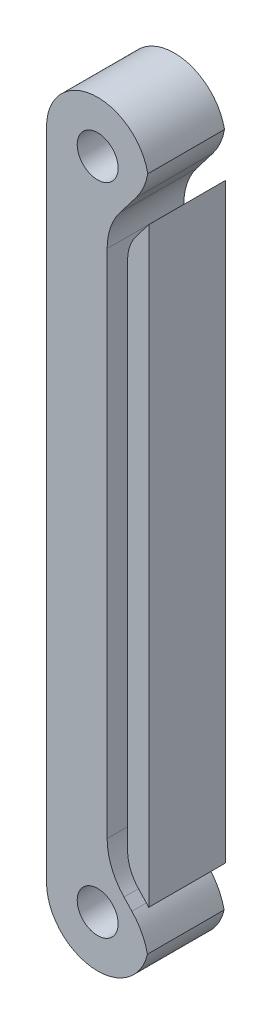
ISO-10303-21;
HEADER;
FILE_DESCRIPTION(('STEP AP214'),'2;1');
FILE_NAME('part.step','',(''),(''),'','','');
FILE_SCHEMA(('AUTOMOTIVE_DESIGN { 1 0 10303 214 1 1 1 1 }'));
ENDSEC;
DATA;
#1=APPLICATION_CONTEXT('core data for automotive mechanical design processes');
#2=APPLICATION_PROTOCOL_DEFINITION('international standard','automotive_design',2000,#1);
#3=PRODUCT_CONTEXT('',#1,'mechanical');
#4=PRODUCT('Part','Part','',(#3));
#5=PRODUCT_RELATED_PRODUCT_CATEGORY('part','',(#4));
#6=PRODUCT_DEFINITION_FORMATION('','',#4);
#7=PRODUCT_DEFINITION_CONTEXT('part definition',#1,'design');
#8=PRODUCT_DEFINITION('design','',#6,#7);
#9=PRODUCT_DEFINITION_SHAPE('','',#8);
#10=(LENGTH_UNIT() NAMED_UNIT(*) SI_UNIT(.MILLI.,.METRE.));
#11=(NAMED_UNIT(*) PLANE_ANGLE_UNIT() SI_UNIT($,.RADIAN.));
#12=(NAMED_UNIT(*) SI_UNIT($,.STERADIAN.) SOLID_ANGLE_UNIT());
#13=UNCERTAINTY_MEASURE_WITH_UNIT(LENGTH_MEASURE(1.E-05),#10,'distance_accuracy_value','');
#14=(GEOMETRIC_REPRESENTATION_CONTEXT(3) GLOBAL_UNCERTAINTY_ASSIGNED_CONTEXT((#13)) GLOBAL_UNIT_ASSIGNED_CONTEXT((#10,
#11,#12)) REPRESENTATION_CONTEXT('',''));
#15=CARTESIAN_POINT('',(0.,0.,0.));
#16=DIRECTION('',(0.,0.,1.));
#17=DIRECTION('',(1.,0.,0.));
#18=AXIS2_PLACEMENT_3D('',#15,#16,#17);
#19=CARTESIAN_POINT('',(0.,40.64,9.525));
#20=DIRECTION('',(0.,0.,1.));
#21=DIRECTION('',(1.,0.,0.));
#22=AXIS2_PLACEMENT_3D('',#19,#20,#21);
#23=PLANE('',#22);
#24=CARTESIAN_POINT('',(-1.27,43.2241388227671,9.525));
#25=DIRECTION('',(0.,0.,-1.));
#26=DIRECTION('',(1.,0.,0.));
#27=AXIS2_PLACEMENT_3D('',#24,#25,#26);
#28=CIRCLE('',#27,7.62);
#29=CARTESIAN_POINT('',(6.22920112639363,41.8727016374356,9.525));
#30=VERTEX_POINT('',#29);
#31=CARTESIAN_POINT('',(4.77808385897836,38.5889385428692,9.525));
#32=VERTEX_POINT('',#31);
#33=EDGE_CURVE('E183',#30,#32,#28,.T.);
#34=ORIENTED_EDGE('',*,*,#33,.F.);
#35=CARTESIAN_POINT('',(0.,40.64,9.525));
#36=DIRECTION('',(0.,0.,1.));
#37=DIRECTION('',(1.,0.,0.));
#38=AXIS2_PLACEMENT_3D('',#35,#36,#37);
#39=CIRCLE('',#38,6.35);
#40=CARTESIAN_POINT('',(-6.35,40.64,9.525));
#41=VERTEX_POINT('',#40);
#42=EDGE_CURVE('E166',#30,#41,#39,.T.);
#43=ORIENTED_EDGE('',*,*,#42,.T.);
#44=DIRECTION('',(0.,-1.,0.));
#45=VECTOR('',#44,1.);
#46=CARTESIAN_POINT('',(-6.35,-40.64,9.525));
#47=LINE('',#46,#45);
#48=CARTESIAN_POINT('',(-6.35,-40.64,9.525));
#49=VERTEX_POINT('',#48);
#50=EDGE_CURVE('E163',#41,#49,#47,.T.);
#51=ORIENTED_EDGE('',*,*,#50,.T.);
#52=CARTESIAN_POINT('',(0.,-40.64,9.525));
#53=DIRECTION('',(0.,0.,1.));
#54=DIRECTION('',(-1.,0.,0.));
#55=AXIS2_PLACEMENT_3D('',#52,#53,#54);
#56=CIRCLE('',#55,6.35);
#57=CARTESIAN_POINT('',(6.18231703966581,-42.0896399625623,9.525));
#58=VERTEX_POINT('',#57);
#59=EDGE_CURVE('E160',#49,#58,#56,.T.);
#60=ORIENTED_EDGE('',*,*,#59,.T.);
#61=CARTESIAN_POINT('',(-1.27,-43.6794106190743,9.525));
#62=DIRECTION('',(0.,0.,-1.));
#63=DIRECTION('',(-1.,0.,0.));
#64=AXIS2_PLACEMENT_3D('',#61,#62,#63);
#65=CIRCLE('',#64,7.62);
#66=CARTESIAN_POINT('',(4.25813786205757,-38.434976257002,9.525));
#67=VERTEX_POINT('',#66);
#68=EDGE_CURVE('E12',#67,#58,#65,.T.);
#69=ORIENTED_EDGE('',*,*,#68,.F.);
#70=DIRECTION('',(0.688245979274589,-0.725477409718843,0.));
#71=VECTOR('',#70,1.);
#72=CARTESIAN_POINT('',(3.26864550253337,-37.3919562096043,9.525));
#73=LINE('',#72,#71);
#74=CARTESIAN_POINT('',(3.26864550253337,-37.3919562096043,9.525));
#75=VERTEX_POINT('',#74);
#76=EDGE_CURVE('E123',#75,#67,#73,.T.);
#77=ORIENTED_EDGE('',*,*,#76,.F.);
#78=CARTESIAN_POINT('',(8.79678336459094,-32.147521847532,9.525));
#79=DIRECTION('',(0.,0.,1.));
#80=DIRECTION('',(1.,0.,0.));
#81=AXIS2_PLACEMENT_3D('',#78,#79,#80);
#82=CIRCLE('',#81,7.62);
#83=CARTESIAN_POINT('',(1.17678336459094,-32.1475218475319,9.525));
#84=VERTEX_POINT('',#83);
#85=EDGE_CURVE('E45',#84,#75,#82,.T.);
#86=ORIENTED_EDGE('',*,*,#85,.F.);
#87=DIRECTION('',(0.,-1.,0.));
#88=VECTOR('',#87,1.);
#89=CARTESIAN_POINT('',(1.17678336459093,31.3057649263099,9.525));
#90=LINE('',#89,#88);
#91=CARTESIAN_POINT('',(1.17678336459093,31.3057649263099,9.525));
#92=VERTEX_POINT('',#91);
#93=EDGE_CURVE('E189',#92,#84,#90,.T.);
#94=ORIENTED_EDGE('',*,*,#93,.F.);
#95=CARTESIAN_POINT('',(8.79678336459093,31.3057649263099,9.525));
#96=DIRECTION('',(0.,0.,1.));
#97=DIRECTION('',(1.,0.,0.));
#98=AXIS2_PLACEMENT_3D('',#95,#96,#97);
#99=CIRCLE('',#98,7.62);
#100=CARTESIAN_POINT('',(2.74869950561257,35.9409652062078,9.525));
#101=VERTEX_POINT('',#100);
#102=EDGE_CURVE('E186',#101,#92,#99,.T.);
#103=ORIENTED_EDGE('',*,*,#102,.F.);
#104=DIRECTION('',(-0.608293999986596,-0.793711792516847,0.));
#105=VECTOR('',#104,1.);
#106=CARTESIAN_POINT('',(4.77808385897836,38.5889385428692,9.525));
#107=LINE('',#106,#105);
#108=EDGE_CURVE('E124',#32,#101,#107,.T.);
#109=ORIENTED_EDGE('',*,*,#108,.F.);
#110=EDGE_LOOP('',(#34,#43,#51,#60,#69,#77,#86,#94,#103,#109));
#111=FACE_BOUND('',#110,.T.);
#112=CARTESIAN_POINT('',(0.,40.64,9.525));
#113=DIRECTION('',(0.,0.,1.));
#114=DIRECTION('',(1.,0.,0.));
#115=AXIS2_PLACEMENT_3D('',#112,#113,#114);
#116=CIRCLE('',#115,2.54);
#117=CARTESIAN_POINT('',(-2.54,40.64,9.525));
#118=VERTEX_POINT('',#117);
#119=EDGE_CURVE('E153',#118,#118,#116,.T.);
#120=ORIENTED_EDGE('',*,*,#119,.F.);
#121=EDGE_LOOP('',(#120));
#122=FACE_BOUND('',#121,.T.);
#123=CARTESIAN_POINT('',(0.,-40.64,9.525));
#124=DIRECTION('',(0.,0.,1.));
#125=DIRECTION('',(1.,0.,0.));
#126=AXIS2_PLACEMENT_3D('',#123,#124,#125);
#127=CIRCLE('',#126,2.54);
#128=CARTESIAN_POINT('',(-2.54,-40.64,9.525));
#129=VERTEX_POINT('',#128);
#130=EDGE_CURVE('E174',#129,#129,#127,.T.);
#131=ORIENTED_EDGE('',*,*,#130,.F.);
#132=EDGE_LOOP('',(#131));
#133=FACE_BOUND('',#132,.T.);
#134=ADVANCED_FACE('F42',(#111,#122,#133),#23,.T.);
#135=CARTESIAN_POINT('',(0.,40.64,0.));
#136=DIRECTION('',(0.,0.,1.));
#137=DIRECTION('',(1.,0.,0.));
#138=AXIS2_PLACEMENT_3D('',#135,#136,#137);
#139=PLANE('',#138);
#140=CARTESIAN_POINT('',(0.,40.64,0.));
#141=DIRECTION('',(0.,0.,1.));
#142=DIRECTION('',(1.,0.,0.));
#143=AXIS2_PLACEMENT_3D('',#140,#141,#142);
#144=CIRCLE('',#143,6.35);
#145=CARTESIAN_POINT('',(6.22920112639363,41.8727016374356,0.));
#146=VERTEX_POINT('',#145);
#147=CARTESIAN_POINT('',(-6.35,40.64,0.));
#148=VERTEX_POINT('',#147);
#149=EDGE_CURVE('E140',#146,#148,#144,.T.);
#150=ORIENTED_EDGE('',*,*,#149,.F.);
#151=CARTESIAN_POINT('',(-1.27,43.2241388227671,0.));
#152=DIRECTION('',(0.,0.,1.));
#153=DIRECTION('',(1.,0.,0.));
#154=AXIS2_PLACEMENT_3D('',#151,#152,#153);
#155=CIRCLE('',#154,7.62);
#156=CARTESIAN_POINT('',(4.77808385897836,38.5889385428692,0.));
#157=VERTEX_POINT('',#156);
#158=EDGE_CURVE('E95',#146,#157,#155,.F.);
#159=ORIENTED_EDGE('',*,*,#158,.T.);
#160=DIRECTION('',(-0.608293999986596,-0.793711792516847,0.));
#161=VECTOR('',#160,1.);
#162=CARTESIAN_POINT('',(4.00036290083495,37.5741557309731,0.));
#163=LINE('',#162,#161);
#164=CARTESIAN_POINT('',(2.74869950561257,35.9409652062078,0.));
#165=VERTEX_POINT('',#164);
#166=EDGE_CURVE('E103',#157,#165,#163,.T.);
#167=ORIENTED_EDGE('',*,*,#166,.T.);
#168=CARTESIAN_POINT('',(8.79678336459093,31.3057649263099,0.));
#169=DIRECTION('',(0.,0.,1.));
#170=DIRECTION('',(1.,0.,0.));
#171=AXIS2_PLACEMENT_3D('',#168,#169,#170);
#172=CIRCLE('',#171,7.62);
#173=CARTESIAN_POINT('',(1.17678336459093,31.3057649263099,0.));
#174=VERTEX_POINT('',#173);
#175=EDGE_CURVE('E134',#165,#174,#172,.T.);
#176=ORIENTED_EDGE('',*,*,#175,.T.);
#177=DIRECTION('',(0.,-1.,0.));
#178=VECTOR('',#177,1.);
#179=CARTESIAN_POINT('',(1.17678336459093,40.64,0.));
#180=LINE('',#179,#178);
#181=CARTESIAN_POINT('',(1.17678336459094,-32.1475218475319,0.));
#182=VERTEX_POINT('',#181);
#183=EDGE_CURVE('E132',#174,#182,#180,.T.);
#184=ORIENTED_EDGE('',*,*,#183,.T.);
#185=CARTESIAN_POINT('',(8.79678336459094,-32.147521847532,0.));
#186=DIRECTION('',(0.,0.,1.));
#187=DIRECTION('',(1.,0.,0.));
#188=AXIS2_PLACEMENT_3D('',#185,#186,#187);
#189=CIRCLE('',#188,7.62);
#190=CARTESIAN_POINT('',(3.26864550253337,-37.3919562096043,0.));
#191=VERTEX_POINT('',#190);
#192=EDGE_CURVE('E115',#182,#191,#189,.T.);
#193=ORIENTED_EDGE('',*,*,#192,.T.);
#194=DIRECTION('',(0.688245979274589,-0.725477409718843,0.));
#195=VECTOR('',#194,1.);
#196=CARTESIAN_POINT('',(-37.2415497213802,5.30968300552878,0.));
#197=LINE('',#196,#195);
#198=CARTESIAN_POINT('',(4.25813786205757,-38.434976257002,0.));
#199=VERTEX_POINT('',#198);
#200=EDGE_CURVE('E111',#191,#199,#197,.T.);
#201=ORIENTED_EDGE('',*,*,#200,.T.);
#202=CARTESIAN_POINT('',(-1.27,-43.6794106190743,0.));
#203=DIRECTION('',(0.,0.,1.));
#204=DIRECTION('',(1.,0.,0.));
#205=AXIS2_PLACEMENT_3D('',#202,#203,#204);
#206=CIRCLE('',#205,7.62);
#207=CARTESIAN_POINT('',(6.18231703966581,-42.0896399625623,0.));
#208=VERTEX_POINT('',#207);
#209=EDGE_CURVE('E60',#199,#208,#206,.F.);
#210=ORIENTED_EDGE('',*,*,#209,.T.);
#211=CARTESIAN_POINT('',(0.,-40.64,0.));
#212=DIRECTION('',(0.,0.,1.));
#213=DIRECTION('',(-1.,0.,0.));
#214=AXIS2_PLACEMENT_3D('',#211,#212,#213);
#215=CIRCLE('',#214,6.35);
#216=CARTESIAN_POINT('',(-6.35,-40.64,0.));
#217=VERTEX_POINT('',#216);
#218=EDGE_CURVE('E146',#217,#208,#215,.T.);
#219=ORIENTED_EDGE('',*,*,#218,.F.);
#220=DIRECTION('',(0.,-1.,0.));
#221=VECTOR('',#220,1.);
#222=CARTESIAN_POINT('',(-6.35,-40.64,0.));
#223=LINE('',#222,#221);
#224=EDGE_CURVE('E150',#148,#217,#223,.T.);
#225=ORIENTED_EDGE('',*,*,#224,.F.);
#226=EDGE_LOOP('',(#150,#159,#167,#176,#184,#193,#201,#210,#219,#225));
#227=FACE_BOUND('',#226,.T.);
#228=CARTESIAN_POINT('',(0.,40.64,0.));
#229=DIRECTION('',(0.,0.,1.));
#230=DIRECTION('',(1.,0.,0.));
#231=AXIS2_PLACEMENT_3D('',#228,#229,#230);
#232=CIRCLE('',#231,2.54);
#233=CARTESIAN_POINT('',(-2.54,40.64,0.));
#234=VERTEX_POINT('',#233);
#235=EDGE_CURVE('E169',#234,#234,#232,.T.);
#236=ORIENTED_EDGE('',*,*,#235,.T.);
#237=EDGE_LOOP('',(#236));
#238=FACE_BOUND('',#237,.T.);
#239=CARTESIAN_POINT('',(0.,-40.64,0.));
#240=DIRECTION('',(0.,0.,1.));
#241=DIRECTION('',(1.,0.,0.));
#242=AXIS2_PLACEMENT_3D('',#239,#240,#241);
#243=CIRCLE('',#242,2.54);
#244=CARTESIAN_POINT('',(-2.54,-40.64,0.));
#245=VERTEX_POINT('',#244);
#246=EDGE_CURVE('E141',#245,#245,#243,.T.);
#247=ORIENTED_EDGE('',*,*,#246,.T.);
#248=EDGE_LOOP('',(#247));
#249=FACE_BOUND('',#248,.T.);
#250=ADVANCED_FACE('F128',(#227,#238,#249),#139,.F.);
#251=CARTESIAN_POINT('',(0.,40.64,9.525));
#252=DIRECTION('',(0.,0.,-1.));
#253=DIRECTION('',(-1.,0.,0.));
#254=AXIS2_PLACEMENT_3D('',#251,#252,#253);
#255=CYLINDRICAL_SURFACE('',#254,6.35);
#256=ORIENTED_EDGE('',*,*,#42,.F.);
#257=DIRECTION('',(0.,0.,1.));
#258=VECTOR('',#257,1.);
#259=CARTESIAN_POINT('',(6.22920112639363,41.8727016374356,4.445));
#260=LINE('',#259,#258);
#261=EDGE_CURVE('E138',#30,#146,#260,.F.);
#262=ORIENTED_EDGE('',*,*,#261,.T.);
#263=ORIENTED_EDGE('',*,*,#149,.T.);
#264=DIRECTION('',(0.,0.,-1.));
#265=VECTOR('',#264,1.);
#266=CARTESIAN_POINT('',(-6.35,40.64,9.525));
#267=LINE('',#266,#265);
#268=EDGE_CURVE('E147',#41,#148,#267,.T.);
#269=ORIENTED_EDGE('',*,*,#268,.F.);
#270=EDGE_LOOP('',(#256,#262,#263,#269));
#271=FACE_BOUND('',#270,.T.);
#272=ADVANCED_FACE('F232',(#271),#255,.T.);
#273=CARTESIAN_POINT('',(-6.35,-40.64,9.525));
#274=DIRECTION('',(1.,0.,0.));
#275=DIRECTION('',(0.,0.,-1.));
#276=AXIS2_PLACEMENT_3D('',#273,#274,#275);
#277=PLANE('',#276);
#278=ORIENTED_EDGE('',*,*,#224,.T.);
#279=DIRECTION('',(0.,0.,-1.));
#280=VECTOR('',#279,1.);
#281=CARTESIAN_POINT('',(-6.35,-40.64,9.525));
#282=LINE('',#281,#280);
#283=EDGE_CURVE('E145',#49,#217,#282,.T.);
#284=ORIENTED_EDGE('',*,*,#283,.F.);
#285=ORIENTED_EDGE('',*,*,#50,.F.);
#286=ORIENTED_EDGE('',*,*,#268,.T.);
#287=EDGE_LOOP('',(#278,#284,#285,#286));
#288=FACE_BOUND('',#287,.T.);
#289=ADVANCED_FACE('F254',(#288),#277,.F.);
#290=CARTESIAN_POINT('',(0.,-40.64,9.525));
#291=DIRECTION('',(0.,0.,-1.));
#292=DIRECTION('',(-1.,0.,0.));
#293=AXIS2_PLACEMENT_3D('',#290,#291,#292);
#294=CYLINDRICAL_SURFACE('',#293,6.35);
#295=ORIENTED_EDGE('',*,*,#218,.T.);
#296=DIRECTION('',(0.,0.,1.));
#297=VECTOR('',#296,1.);
#298=CARTESIAN_POINT('',(6.18231703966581,-42.0896399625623,4.445));
#299=LINE('',#298,#297);
#300=EDGE_CURVE('E142',#208,#58,#299,.T.);
#301=ORIENTED_EDGE('',*,*,#300,.T.);
#302=ORIENTED_EDGE('',*,*,#59,.F.);
#303=ORIENTED_EDGE('',*,*,#283,.T.);
#304=EDGE_LOOP('',(#295,#301,#302,#303));
#305=FACE_BOUND('',#304,.T.);
#306=ADVANCED_FACE('F207',(#305),#294,.T.);
#307=CARTESIAN_POINT('',(0.,40.64,9.525));
#308=DIRECTION('',(0.,0.,-1.));
#309=DIRECTION('',(-1.,0.,0.));
#310=AXIS2_PLACEMENT_3D('',#307,#308,#309);
#311=CYLINDRICAL_SURFACE('',#310,2.54);
#312=CARTESIAN_POINT('',(-2.54,40.64,9.525));
#313=CARTESIAN_POINT('',(-2.54,40.64,9.42578125));
#314=CARTESIAN_POINT('',(-2.54,40.64,9.3265625));
#315=CARTESIAN_POINT('',(-2.54,40.64,9.128125));
#316=CARTESIAN_POINT('',(-2.54,40.64,9.02890625));
#317=CARTESIAN_POINT('',(-2.54,40.64,8.83046875));
#318=CARTESIAN_POINT('',(-2.54,40.64,8.73125));
#319=CARTESIAN_POINT('',(-2.54,40.64,8.5328125));
#320=CARTESIAN_POINT('',(-2.54,40.64,8.43359375));
#321=CARTESIAN_POINT('',(-2.54,40.64,8.23515625));
#322=CARTESIAN_POINT('',(-2.54,40.64,8.1359375));
#323=CARTESIAN_POINT('',(-2.54,40.64,7.9375));
#324=CARTESIAN_POINT('',(-2.54,40.64,7.83828125));
#325=CARTESIAN_POINT('',(-2.54,40.64,7.63984375));
#326=CARTESIAN_POINT('',(-2.54,40.64,7.540625));
#327=CARTESIAN_POINT('',(-2.54,40.64,7.3421875));
#328=CARTESIAN_POINT('',(-2.54,40.64,7.24296875));
#329=CARTESIAN_POINT('',(-2.54,40.64,7.04453125));
#330=CARTESIAN_POINT('',(-2.54,40.64,6.9453125));
#331=CARTESIAN_POINT('',(-2.54,40.64,6.746875));
#332=CARTESIAN_POINT('',(-2.54,40.64,6.64765625));
#333=CARTESIAN_POINT('',(-2.54,40.64,6.44921875));
#334=CARTESIAN_POINT('',(-2.54,40.64,6.35));
#335=CARTESIAN_POINT('',(-2.54,40.64,6.1515625));
#336=CARTESIAN_POINT('',(-2.54,40.64,6.05234375));
#337=CARTESIAN_POINT('',(-2.54,40.64,5.85390625));
#338=CARTESIAN_POINT('',(-2.54,40.64,5.7546875));
#339=CARTESIAN_POINT('',(-2.54,40.64,5.55625));
#340=CARTESIAN_POINT('',(-2.54,40.64,5.45703125));
#341=CARTESIAN_POINT('',(-2.54,40.64,5.25859375));
#342=CARTESIAN_POINT('',(-2.54,40.64,5.159375));
#343=CARTESIAN_POINT('',(-2.54,40.64,4.9609375));
#344=CARTESIAN_POINT('',(-2.54,40.64,4.86171875));
#345=CARTESIAN_POINT('',(-2.54,40.64,4.66328125));
#346=CARTESIAN_POINT('',(-2.54,40.64,4.5640625));
#347=CARTESIAN_POINT('',(-2.54,40.64,4.365625));
#348=CARTESIAN_POINT('',(-2.54,40.64,4.26640625));
#349=CARTESIAN_POINT('',(-2.54,40.64,4.06796875));
#350=CARTESIAN_POINT('',(-2.54,40.64,3.96875));
#351=CARTESIAN_POINT('',(-2.54,40.64,3.7703125));
#352=CARTESIAN_POINT('',(-2.54,40.64,3.67109375));
#353=CARTESIAN_POINT('',(-2.54,40.64,3.47265625));
#354=CARTESIAN_POINT('',(-2.54,40.64,3.3734375));
#355=CARTESIAN_POINT('',(-2.54,40.64,3.175));
#356=CARTESIAN_POINT('',(-2.54,40.64,3.07578125));
#357=CARTESIAN_POINT('',(-2.54,40.64,2.87734375));
#358=CARTESIAN_POINT('',(-2.54,40.64,2.778125));
#359=CARTESIAN_POINT('',(-2.54,40.64,2.5796875));
#360=CARTESIAN_POINT('',(-2.54,40.64,2.48046875));
#361=CARTESIAN_POINT('',(-2.54,40.64,2.28203125));
#362=CARTESIAN_POINT('',(-2.54,40.64,2.1828125));
#363=CARTESIAN_POINT('',(-2.54,40.64,1.984375));
#364=CARTESIAN_POINT('',(-2.54,40.64,1.88515625));
#365=CARTESIAN_POINT('',(-2.54,40.64,1.68671875));
#366=CARTESIAN_POINT('',(-2.54,40.64,1.5875));
#367=CARTESIAN_POINT('',(-2.54,40.64,1.3890625));
#368=CARTESIAN_POINT('',(-2.54,40.64,1.28984375));
#369=CARTESIAN_POINT('',(-2.54,40.64,1.09140625));
#370=CARTESIAN_POINT('',(-2.54,40.64,0.992187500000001));
#371=CARTESIAN_POINT('',(-2.54,40.64,0.793750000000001));
#372=CARTESIAN_POINT('',(-2.54,40.64,0.69453125));
#373=CARTESIAN_POINT('',(-2.54,40.64,0.49609375));
#374=CARTESIAN_POINT('',(-2.54,40.64,0.396875));
#375=CARTESIAN_POINT('',(-2.54,40.64,0.1984375));
#376=CARTESIAN_POINT('',(-2.54,40.64,0.0992187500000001));
#377=CARTESIAN_POINT('',(-2.54,40.64,0.));
#378=B_SPLINE_CURVE_WITH_KNOTS('',3,(#312,#313,#314,#315,#316,#317,#318,#319,#320,#321,#322,
#323,#324,#325,#326,#327,#328,#329,#330,#331,#332,#333,#334,#335,#336,#337,#338,#339,#340,#341,
#342,#343,#344,#345,#346,#347,#348,#349,#350,#351,#352,#353,#354,#355,#356,#357,#358,#359,#360,
#361,#362,#363,#364,#365,#366,#367,#368,#369,#370,#371,#372,#373,#374,#375,#376,#377),
.UNSPECIFIED.,.F.,.F.,(4,2,2,2,2,2,2,2,2,2,2,2,2,2,2,2,2,2,2,2,2,2,2,2,2,2,2,2,2,2,2,2,4),(0.,
0.297656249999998,0.595312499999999,0.892968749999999,1.190625,1.48828125,1.7859375,2.08359375,
2.38125,2.67890625,2.9765625,3.27421875,3.571875,3.86953125,4.1671875,4.46484375,4.7625,
5.06015625,5.3578125,5.65546875,5.953125,6.25078125,6.5484375,6.84609375,7.14375,7.44140625,
7.7390625,8.03671875,8.334375,8.63203125,8.9296875,9.22734375,9.525),.UNSPECIFIED.);
#379=EDGE_CURVE('BSEAM263',#118,#234,#378,.T.);
#380=ORIENTED_EDGE('',*,*,#119,.T.);
#381=ORIENTED_EDGE('',*,*,#235,.F.);
#382=ORIENTED_EDGE('',*,*,#379,.T.);
#383=ORIENTED_EDGE('',*,*,#379,.F.);
#384=EDGE_LOOP('',(#380,#382,#381,#383));
#385=FACE_BOUND('',#384,.T.);
#386=ADVANCED_FACE('F263',(#385),#311,.F.);
#387=CARTESIAN_POINT('',(0.,-40.64,9.525));
#388=DIRECTION('',(0.,0.,-1.));
#389=DIRECTION('',(-1.,0.,0.));
#390=AXIS2_PLACEMENT_3D('',#387,#388,#389);
#391=CYLINDRICAL_SURFACE('',#390,2.54);
#392=CARTESIAN_POINT('',(-2.54,-40.64,9.525));
#393=CARTESIAN_POINT('',(-2.54,-40.64,9.42578125));
#394=CARTESIAN_POINT('',(-2.54,-40.64,9.3265625));
#395=CARTESIAN_POINT('',(-2.54,-40.64,9.128125));
#396=CARTESIAN_POINT('',(-2.54,-40.64,9.02890625));
#397=CARTESIAN_POINT('',(-2.54,-40.64,8.83046875));
#398=CARTESIAN_POINT('',(-2.54,-40.64,8.73125));
#399=CARTESIAN_POINT('',(-2.54,-40.64,8.5328125));
#400=CARTESIAN_POINT('',(-2.54,-40.64,8.43359375));
#401=CARTESIAN_POINT('',(-2.54,-40.64,8.23515625));
#402=CARTESIAN_POINT('',(-2.54,-40.64,8.1359375));
#403=CARTESIAN_POINT('',(-2.54,-40.64,7.9375));
#404=CARTESIAN_POINT('',(-2.54,-40.64,7.83828125));
#405=CARTESIAN_POINT('',(-2.54,-40.64,7.63984375));
#406=CARTESIAN_POINT('',(-2.54,-40.64,7.540625));
#407=CARTESIAN_POINT('',(-2.54,-40.64,7.3421875));
#408=CARTESIAN_POINT('',(-2.54,-40.64,7.24296875));
#409=CARTESIAN_POINT('',(-2.54,-40.64,7.04453125));
#410=CARTESIAN_POINT('',(-2.54,-40.64,6.9453125));
#411=CARTESIAN_POINT('',(-2.54,-40.64,6.746875));
#412=CARTESIAN_POINT('',(-2.54,-40.64,6.64765625));
#413=CARTESIAN_POINT('',(-2.54,-40.64,6.44921875));
#414=CARTESIAN_POINT('',(-2.54,-40.64,6.35));
#415=CARTESIAN_POINT('',(-2.54,-40.64,6.1515625));
#416=CARTESIAN_POINT('',(-2.54,-40.64,6.05234375));
#417=CARTESIAN_POINT('',(-2.54,-40.64,5.85390625));
#418=CARTESIAN_POINT('',(-2.54,-40.64,5.7546875));
#419=CARTESIAN_POINT('',(-2.54,-40.64,5.55625));
#420=CARTESIAN_POINT('',(-2.54,-40.64,5.45703125));
#421=CARTESIAN_POINT('',(-2.54,-40.64,5.25859375));
#422=CARTESIAN_POINT('',(-2.54,-40.64,5.159375));
#423=CARTESIAN_POINT('',(-2.54,-40.64,4.9609375));
#424=CARTESIAN_POINT('',(-2.54,-40.64,4.86171875));
#425=CARTESIAN_POINT('',(-2.54,-40.64,4.66328125));
#426=CARTESIAN_POINT('',(-2.54,-40.64,4.5640625));
#427=CARTESIAN_POINT('',(-2.54,-40.64,4.365625));
#428=CARTESIAN_POINT('',(-2.54,-40.64,4.26640625));
#429=CARTESIAN_POINT('',(-2.54,-40.64,4.06796875));
#430=CARTESIAN_POINT('',(-2.54,-40.64,3.96875));
#431=CARTESIAN_POINT('',(-2.54,-40.64,3.7703125));
#432=CARTESIAN_POINT('',(-2.54,-40.64,3.67109375));
#433=CARTESIAN_POINT('',(-2.54,-40.64,3.47265625));
#434=CARTESIAN_POINT('',(-2.54,-40.64,3.3734375));
#435=CARTESIAN_POINT('',(-2.54,-40.64,3.175));
#436=CARTESIAN_POINT('',(-2.54,-40.64,3.07578125));
#437=CARTESIAN_POINT('',(-2.54,-40.64,2.87734375));
#438=CARTESIAN_POINT('',(-2.54,-40.64,2.778125));
#439=CARTESIAN_POINT('',(-2.54,-40.64,2.5796875));
#440=CARTESIAN_POINT('',(-2.54,-40.64,2.48046875));
#441=CARTESIAN_POINT('',(-2.54,-40.64,2.28203125));
#442=CARTESIAN_POINT('',(-2.54,-40.64,2.1828125));
#443=CARTESIAN_POINT('',(-2.54,-40.64,1.984375));
#444=CARTESIAN_POINT('',(-2.54,-40.64,1.88515625));
#445=CARTESIAN_POINT('',(-2.54,-40.64,1.68671875));
#446=CARTESIAN_POINT('',(-2.54,-40.64,1.5875));
#447=CARTESIAN_POINT('',(-2.54,-40.64,1.3890625));
#448=CARTESIAN_POINT('',(-2.54,-40.64,1.28984375));
#449=CARTESIAN_POINT('',(-2.54,-40.64,1.09140625));
#450=CARTESIAN_POINT('',(-2.54,-40.64,0.992187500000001));
#451=CARTESIAN_POINT('',(-2.54,-40.64,0.793750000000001));
#452=CARTESIAN_POINT('',(-2.54,-40.64,0.69453125));
#453=CARTESIAN_POINT('',(-2.54,-40.64,0.49609375));
#454=CARTESIAN_POINT('',(-2.54,-40.64,0.396875));
#455=CARTESIAN_POINT('',(-2.54,-40.64,0.1984375));
#456=CARTESIAN_POINT('',(-2.54,-40.64,0.0992187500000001));
#457=CARTESIAN_POINT('',(-2.54,-40.64,0.));
#458=B_SPLINE_CURVE_WITH_KNOTS('',3,(#392,#393,#394,#395,#396,#397,#398,#399,#400,#401,#402,
#403,#404,#405,#406,#407,#408,#409,#410,#411,#412,#413,#414,#415,#416,#417,#418,#419,#420,#421,
#422,#423,#424,#425,#426,#427,#428,#429,#430,#431,#432,#433,#434,#435,#436,#437,#438,#439,#440,
#441,#442,#443,#444,#445,#446,#447,#448,#449,#450,#451,#452,#453,#454,#455,#456,#457),
.UNSPECIFIED.,.F.,.F.,(4,2,2,2,2,2,2,2,2,2,2,2,2,2,2,2,2,2,2,2,2,2,2,2,2,2,2,2,2,2,2,2,4),(0.,
0.297656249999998,0.595312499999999,0.892968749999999,1.190625,1.48828125,1.7859375,2.08359375,
2.38125,2.67890625,2.9765625,3.27421875,3.571875,3.86953125,4.1671875,4.46484375,4.7625,
5.06015625,5.3578125,5.65546875,5.953125,6.25078125,6.5484375,6.84609375,7.14375,7.44140625,
7.7390625,8.03671875,8.334375,8.63203125,8.9296875,9.22734375,9.525),.UNSPECIFIED.);
#459=EDGE_CURVE('BSEAM245',#129,#245,#458,.T.);
#460=ORIENTED_EDGE('',*,*,#130,.T.);
#461=ORIENTED_EDGE('',*,*,#246,.F.);
#462=ORIENTED_EDGE('',*,*,#459,.T.);
#463=ORIENTED_EDGE('',*,*,#459,.F.);
#464=EDGE_LOOP('',(#460,#462,#461,#463));
#465=FACE_BOUND('',#464,.T.);
#466=ADVANCED_FACE('F245',(#465),#391,.F.);
#467=CARTESIAN_POINT('',(8.79678336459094,-32.147521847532,-0.635));
#468=DIRECTION('',(0.,0.,1.));
#469=DIRECTION('',(1.,0.,0.));
#470=AXIS2_PLACEMENT_3D('',#467,#468,#469);
#471=CYLINDRICAL_SURFACE('',#470,7.62);
#472=DIRECTION('',(0.,0.,1.));
#473=VECTOR('',#472,1.);
#474=CARTESIAN_POINT('',(1.17678336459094,-32.1475218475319,-0.635));
#475=LINE('',#474,#473);
#476=EDGE_CURVE('E179',#182,#84,#475,.T.);
#477=ORIENTED_EDGE('',*,*,#476,.T.);
#478=ORIENTED_EDGE('',*,*,#85,.T.);
#479=DIRECTION('',(0.,0.,1.));
#480=VECTOR('',#479,1.);
#481=CARTESIAN_POINT('',(3.26864550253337,-37.3919562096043,-0.635));
#482=LINE('',#481,#480);
#483=EDGE_CURVE('E108',#191,#75,#482,.T.);
#484=ORIENTED_EDGE('',*,*,#483,.F.);
#485=ORIENTED_EDGE('',*,*,#192,.F.);
#486=EDGE_LOOP('',(#477,#478,#484,#485));
#487=FACE_BOUND('',#486,.T.);
#488=ADVANCED_FACE('F119',(#487),#471,.F.);
#489=CARTESIAN_POINT('',(1.17678336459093,31.3057649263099,-0.635));
#490=DIRECTION('',(-1.,0.,0.));
#491=DIRECTION('',(0.,-1.,0.));
#492=AXIS2_PLACEMENT_3D('',#489,#490,#491);
#493=PLANE('',#492);
#494=DIRECTION('',(0.,0.,1.));
#495=VECTOR('',#494,1.);
#496=CARTESIAN_POINT('',(1.17678336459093,31.3057649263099,-0.635));
#497=LINE('',#496,#495);
#498=EDGE_CURVE('E190',#174,#92,#497,.T.);
#499=ORIENTED_EDGE('',*,*,#498,.T.);
#500=ORIENTED_EDGE('',*,*,#93,.T.);
#501=ORIENTED_EDGE('',*,*,#476,.F.);
#502=ORIENTED_EDGE('',*,*,#183,.F.);
#503=EDGE_LOOP('',(#499,#500,#501,#502));
#504=FACE_BOUND('',#503,.T.);
#505=ADVANCED_FACE('F237',(#504),#493,.F.);
#506=CARTESIAN_POINT('',(8.79678336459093,31.3057649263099,-0.635));
#507=DIRECTION('',(0.,0.,1.));
#508=DIRECTION('',(1.,0.,0.));
#509=AXIS2_PLACEMENT_3D('',#506,#507,#508);
#510=CYLINDRICAL_SURFACE('',#509,7.62);
#511=DIRECTION('',(0.,0.,1.));
#512=VECTOR('',#511,1.);
#513=CARTESIAN_POINT('',(2.74869950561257,35.9409652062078,-0.635));
#514=LINE('',#513,#512);
#515=EDGE_CURVE('E187',#165,#101,#514,.T.);
#516=ORIENTED_EDGE('',*,*,#515,.T.);
#517=ORIENTED_EDGE('',*,*,#102,.T.);
#518=ORIENTED_EDGE('',*,*,#498,.F.);
#519=ORIENTED_EDGE('',*,*,#175,.F.);
#520=EDGE_LOOP('',(#516,#517,#518,#519));
#521=FACE_BOUND('',#520,.T.);
#522=ADVANCED_FACE('F224',(#521),#510,.F.);
#523=CARTESIAN_POINT('',(4.77808385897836,38.5889385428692,-0.635));
#524=DIRECTION('',(-0.793711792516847,0.608293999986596,0.));
#525=DIRECTION('',(-0.608293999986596,-0.793711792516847,0.));
#526=AXIS2_PLACEMENT_3D('',#523,#524,#525);
#527=PLANE('',#526);
#528=DIRECTION('',(0.,0.,1.));
#529=VECTOR('',#528,1.);
#530=CARTESIAN_POINT('',(4.77808385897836,38.5889385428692,-0.635));
#531=LINE('',#530,#529);
#532=EDGE_CURVE('E184',#157,#32,#531,.T.);
#533=ORIENTED_EDGE('',*,*,#532,.T.);
#534=ORIENTED_EDGE('',*,*,#108,.T.);
#535=ORIENTED_EDGE('',*,*,#515,.F.);
#536=ORIENTED_EDGE('',*,*,#166,.F.);
#537=EDGE_LOOP('',(#533,#534,#535,#536));
#538=FACE_BOUND('',#537,.T.);
#539=ADVANCED_FACE('F225',(#538),#527,.F.);
#540=CARTESIAN_POINT('',(3.26864550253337,-37.3919562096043,-0.635));
#541=DIRECTION('',(-0.725477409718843,-0.688245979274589,0.));
#542=DIRECTION('',(0.688245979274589,-0.725477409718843,0.));
#543=AXIS2_PLACEMENT_3D('',#540,#541,#542);
#544=PLANE('',#543);
#545=ORIENTED_EDGE('',*,*,#483,.T.);
#546=ORIENTED_EDGE('',*,*,#76,.T.);
#547=DIRECTION('',(0.,0.,1.));
#548=VECTOR('',#547,1.);
#549=CARTESIAN_POINT('',(4.25813786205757,-38.434976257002,-0.635));
#550=LINE('',#549,#548);
#551=EDGE_CURVE('E51',#199,#67,#550,.T.);
#552=ORIENTED_EDGE('',*,*,#551,.F.);
#553=ORIENTED_EDGE('',*,*,#200,.F.);
#554=EDGE_LOOP('',(#545,#546,#552,#553));
#555=FACE_BOUND('',#554,.T.);
#556=ADVANCED_FACE('F112',(#555),#544,.F.);
#557=CARTESIAN_POINT('',(-1.27,43.2241388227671,-0.635));
#558=DIRECTION('',(0.,0.,1.));
#559=DIRECTION('',(1.,0.,0.));
#560=AXIS2_PLACEMENT_3D('',#557,#558,#559);
#561=CYLINDRICAL_SURFACE('',#560,7.62);
#562=ORIENTED_EDGE('',*,*,#261,.F.);
#563=ORIENTED_EDGE('',*,*,#33,.T.);
#564=ORIENTED_EDGE('',*,*,#532,.F.);
#565=ORIENTED_EDGE('',*,*,#158,.F.);
#566=EDGE_LOOP('',(#562,#563,#564,#565));
#567=FACE_BOUND('',#566,.T.);
#568=ADVANCED_FACE('F233',(#567),#561,.T.);
#569=CARTESIAN_POINT('',(-1.27,-43.6794106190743,-0.635));
#570=DIRECTION('',(0.,0.,1.));
#571=DIRECTION('',(1.,0.,0.));
#572=AXIS2_PLACEMENT_3D('',#569,#570,#571);
#573=CYLINDRICAL_SURFACE('',#572,7.62);
#574=ORIENTED_EDGE('',*,*,#551,.T.);
#575=ORIENTED_EDGE('',*,*,#68,.T.);
#576=ORIENTED_EDGE('',*,*,#300,.F.);
#577=ORIENTED_EDGE('',*,*,#209,.F.);
#578=EDGE_LOOP('',(#574,#575,#576,#577));
#579=FACE_BOUND('',#578,.T.);
#580=ADVANCED_FACE('F205',(#579),#573,.T.);
#581=CLOSED_SHELL('',(#134,#250,#272,#289,#306,#386,#466,#488,#505,#522,#539,#556,#568,#580));
#582=MANIFOLD_SOLID_BREP('B2',#581);
#583=CARTESIAN_POINT('',(6.35,-40.64,9.525));
#584=DIRECTION('',(-1.,0.,0.));
#585=DIRECTION('',(0.,0.,1.));
#586=AXIS2_PLACEMENT_3D('',#583,#584,#585);
#587=PLANE('',#586);
#588=DIRECTION('',(0.,1.,0.));
#589=VECTOR('',#588,1.);
#590=CARTESIAN_POINT('',(6.35,-40.64,0.));
#591=LINE('',#590,#589);
#592=CARTESIAN_POINT('',(6.35,-36.9592022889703,0.));
#593=VERTEX_POINT('',#592);
#594=CARTESIAN_POINT('',(6.35,36.4643875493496,0.));
#595=VERTEX_POINT('',#594);
#596=EDGE_CURVE('E467',#593,#595,#591,.T.);
#597=ORIENTED_EDGE('',*,*,#596,.T.);
#598=DIRECTION('',(0.,0.,1.));
#599=VECTOR('',#598,1.);
#600=CARTESIAN_POINT('',(6.35,36.4643875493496,9.525));
#601=LINE('',#600,#599);
#602=CARTESIAN_POINT('',(6.35,36.4643875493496,9.525));
#603=VERTEX_POINT('',#602);
#604=EDGE_CURVE('E473',#595,#603,#601,.T.);
#605=ORIENTED_EDGE('',*,*,#604,.T.);
#606=DIRECTION('',(0.,1.,0.));
#607=VECTOR('',#606,1.);
#608=CARTESIAN_POINT('',(6.35,-40.64,9.525));
#609=LINE('',#608,#607);
#610=CARTESIAN_POINT('',(6.35,-36.9592022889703,9.525));
#611=VERTEX_POINT('',#610);
#612=EDGE_CURVE('E468',#611,#603,#609,.T.);
#613=ORIENTED_EDGE('',*,*,#612,.F.);
#614=DIRECTION('',(0.,0.,1.));
#615=VECTOR('',#614,1.);
#616=CARTESIAN_POINT('',(6.35,-36.9592022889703,-0.635));
#617=LINE('',#616,#615);
#618=EDGE_CURVE('E436',#611,#593,#617,.F.);
#619=ORIENTED_EDGE('',*,*,#618,.T.);
#620=EDGE_LOOP('',(#597,#605,#613,#619));
#621=FACE_BOUND('',#620,.T.);
#622=ADVANCED_FACE('F364',(#621),#587,.F.);
#623=CARTESIAN_POINT('',(0.,40.64,0.));
#624=DIRECTION('',(0.,0.,1.));
#625=DIRECTION('',(1.,0.,0.));
#626=AXIS2_PLACEMENT_3D('',#623,#624,#625);
#627=PLANE('',#626);
#628=CARTESIAN_POINT('',(8.79678336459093,31.3057649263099,0.));
#629=DIRECTION('',(0.,0.,1.));
#630=DIRECTION('',(1.,0.,0.));
#631=AXIS2_PLACEMENT_3D('',#628,#629,#630);
#632=CIRCLE('',#631,5.08);
#633=CARTESIAN_POINT('',(3.71678336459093,31.3057649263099,0.));
#634=VERTEX_POINT('',#633);
#635=CARTESIAN_POINT('',(4.76472745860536,34.3958984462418,0.));
#636=VERTEX_POINT('',#635);
#637=EDGE_CURVE('E40',#634,#636,#632,.F.);
#638=ORIENTED_EDGE('',*,*,#637,.T.);
#639=DIRECTION('',(0.608293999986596,0.793711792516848,0.));
#640=VECTOR('',#639,1.);
#641=CARTESIAN_POINT('',(6.01639085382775,36.0290889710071,0.));
#642=LINE('',#641,#640);
#643=EDGE_CURVE('E464',#636,#595,#642,.T.);
#644=ORIENTED_EDGE('',*,*,#643,.T.);
#645=ORIENTED_EDGE('',*,*,#596,.F.);
#646=CARTESIAN_POINT('',(-1.27,-43.6794106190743,0.));
#647=DIRECTION('',(0.,0.,1.));
#648=DIRECTION('',(1.,0.,0.));
#649=AXIS2_PLACEMENT_3D('',#646,#647,#648);
#650=CIRCLE('',#649,10.16);
#651=CARTESIAN_POINT('',(6.10085048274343,-36.6868314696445,0.));
#652=VERTEX_POINT('',#651);
#653=EDGE_CURVE('E378',#593,#652,#650,.T.);
#654=ORIENTED_EDGE('',*,*,#653,.T.);
#655=DIRECTION('',(-0.688245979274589,0.725477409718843,0.));
#656=VECTOR('',#655,1.);
#657=CARTESIAN_POINT('',(-35.3988371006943,7.05782779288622,0.));
#658=LINE('',#657,#656);
#659=CARTESIAN_POINT('',(5.11135812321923,-35.6438114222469,0.));
#660=VERTEX_POINT('',#659);
#661=EDGE_CURVE('E429',#652,#660,#658,.T.);
#662=ORIENTED_EDGE('',*,*,#661,.T.);
#663=CARTESIAN_POINT('',(8.79678336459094,-32.147521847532,0.));
#664=DIRECTION('',(0.,0.,1.));
#665=DIRECTION('',(1.,0.,0.));
#666=AXIS2_PLACEMENT_3D('',#663,#664,#665);
#667=CIRCLE('',#666,5.08);
#668=CARTESIAN_POINT('',(3.71678336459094,-32.1475218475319,0.));
#669=VERTEX_POINT('',#668);
#670=EDGE_CURVE('E477',#660,#669,#667,.F.);
#671=ORIENTED_EDGE('',*,*,#670,.T.);
#672=DIRECTION('',(0.,1.,0.));
#673=VECTOR('',#672,1.);
#674=CARTESIAN_POINT('',(3.71678336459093,40.64,0.));
#675=LINE('',#674,#673);
#676=EDGE_CURVE('E371',#669,#634,#675,.T.);
#677=ORIENTED_EDGE('',*,*,#676,.T.);
#678=EDGE_LOOP('',(#638,#644,#645,#654,#662,#671,#677));
#679=FACE_BOUND('',#678,.T.);
#680=ADVANCED_FACE('F481',(#679),#627,.F.);
#681=CARTESIAN_POINT('',(0.,40.64,9.525));
#682=DIRECTION('',(0.,0.,1.));
#683=DIRECTION('',(1.,0.,0.));
#684=AXIS2_PLACEMENT_3D('',#681,#682,#683);
#685=PLANE('',#684);
#686=DIRECTION('',(0.608293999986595,0.793711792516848,0.));
#687=VECTOR('',#686,1.);
#688=CARTESIAN_POINT('',(6.79411181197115,37.0438717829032,9.525));
#689=LINE('',#688,#687);
#690=CARTESIAN_POINT('',(4.76472745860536,34.3958984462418,9.525));
#691=VERTEX_POINT('',#690);
#692=EDGE_CURVE('E431',#691,#603,#689,.T.);
#693=ORIENTED_EDGE('',*,*,#692,.F.);
#694=CARTESIAN_POINT('',(8.79678336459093,31.3057649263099,9.525));
#695=DIRECTION('',(0.,0.,-1.));
#696=DIRECTION('',(1.,0.,0.));
#697=AXIS2_PLACEMENT_3D('',#694,#695,#696);
#698=CIRCLE('',#697,5.08);
#699=CARTESIAN_POINT('',(3.71678336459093,31.3057649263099,9.525));
#700=VERTEX_POINT('',#699);
#701=EDGE_CURVE('E452',#700,#691,#698,.T.);
#702=ORIENTED_EDGE('',*,*,#701,.F.);
#703=DIRECTION('',(0.,1.,0.));
#704=VECTOR('',#703,1.);
#705=CARTESIAN_POINT('',(3.71678336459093,31.3057649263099,9.525));
#706=LINE('',#705,#704);
#707=CARTESIAN_POINT('',(3.71678336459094,-32.1475218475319,9.525));
#708=VERTEX_POINT('',#707);
#709=EDGE_CURVE('E447',#708,#700,#706,.T.);
#710=ORIENTED_EDGE('',*,*,#709,.F.);
#711=CARTESIAN_POINT('',(8.79678336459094,-32.147521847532,9.525));
#712=DIRECTION('',(0.,0.,-1.));
#713=DIRECTION('',(1.,0.,0.));
#714=AXIS2_PLACEMENT_3D('',#711,#712,#713);
#715=CIRCLE('',#714,5.08);
#716=CARTESIAN_POINT('',(5.11135812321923,-35.6438114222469,9.525));
#717=VERTEX_POINT('',#716);
#718=EDGE_CURVE('E445',#717,#708,#715,.T.);
#719=ORIENTED_EDGE('',*,*,#718,.F.);
#720=DIRECTION('',(-0.688245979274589,0.725477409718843,0.));
#721=VECTOR('',#720,1.);
#722=CARTESIAN_POINT('',(5.11135812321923,-35.6438114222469,9.525));
#723=LINE('',#722,#721);
#724=CARTESIAN_POINT('',(6.10085048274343,-36.6868314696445,9.525));
#725=VERTEX_POINT('',#724);
#726=EDGE_CURVE('E426',#725,#717,#723,.T.);
#727=ORIENTED_EDGE('',*,*,#726,.F.);
#728=CARTESIAN_POINT('',(-1.27,-43.6794106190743,9.525));
#729=DIRECTION('',(0.,0.,1.));
#730=DIRECTION('',(-1.,0.,0.));
#731=AXIS2_PLACEMENT_3D('',#728,#729,#730);
#732=CIRCLE('',#731,10.16);
#733=EDGE_CURVE('E434',#611,#725,#732,.T.);
#734=ORIENTED_EDGE('',*,*,#733,.F.);
#735=ORIENTED_EDGE('',*,*,#612,.T.);
#736=EDGE_LOOP('',(#693,#702,#710,#719,#727,#734,#735));
#737=FACE_BOUND('',#736,.T.);
#738=ADVANCED_FACE('F442',(#737),#685,.T.);
#739=CARTESIAN_POINT('',(6.79411181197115,37.0438717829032,-0.635));
#740=DIRECTION('',(0.793711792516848,-0.608293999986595,0.));
#741=DIRECTION('',(0.608293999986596,0.793711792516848,0.));
#742=AXIS2_PLACEMENT_3D('',#739,#740,#741);
#743=PLANE('',#742);
#744=DIRECTION('',(0.,0.,1.));
#745=VECTOR('',#744,1.);
#746=CARTESIAN_POINT('',(4.76472745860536,34.3958984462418,-0.635));
#747=LINE('',#746,#745);
#748=EDGE_CURVE('E456',#636,#691,#747,.T.);
#749=ORIENTED_EDGE('',*,*,#748,.T.);
#750=ORIENTED_EDGE('',*,*,#692,.T.);
#751=ORIENTED_EDGE('',*,*,#604,.F.);
#752=ORIENTED_EDGE('',*,*,#643,.F.);
#753=EDGE_LOOP('',(#749,#750,#751,#752));
#754=FACE_BOUND('',#753,.T.);
#755=ADVANCED_FACE('F490',(#754),#743,.F.);
#756=CARTESIAN_POINT('',(-1.27,-43.6794106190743,-0.635));
#757=DIRECTION('',(0.,0.,1.));
#758=DIRECTION('',(1.,0.,0.));
#759=AXIS2_PLACEMENT_3D('',#756,#757,#758);
#760=CYLINDRICAL_SURFACE('',#759,10.16);
#761=ORIENTED_EDGE('',*,*,#618,.F.);
#762=ORIENTED_EDGE('',*,*,#733,.T.);
#763=DIRECTION('',(0.,0.,1.));
#764=VECTOR('',#763,1.);
#765=CARTESIAN_POINT('',(6.10085048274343,-36.6868314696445,-0.635));
#766=LINE('',#765,#764);
#767=EDGE_CURVE('E421',#652,#725,#766,.T.);
#768=ORIENTED_EDGE('',*,*,#767,.F.);
#769=ORIENTED_EDGE('',*,*,#653,.F.);
#770=EDGE_LOOP('',(#761,#762,#768,#769));
#771=FACE_BOUND('',#770,.T.);
#772=ADVANCED_FACE('F435',(#771),#760,.F.);
#773=CARTESIAN_POINT('',(5.11135812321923,-35.6438114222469,-0.635));
#774=DIRECTION('',(0.725477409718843,0.688245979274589,0.));
#775=DIRECTION('',(-0.688245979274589,0.725477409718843,0.));
#776=AXIS2_PLACEMENT_3D('',#773,#774,#775);
#777=PLANE('',#776);
#778=ORIENTED_EDGE('',*,*,#767,.T.);
#779=ORIENTED_EDGE('',*,*,#726,.T.);
#780=DIRECTION('',(0.,0.,1.));
#781=VECTOR('',#780,1.);
#782=CARTESIAN_POINT('',(5.11135812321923,-35.6438114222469,-0.635));
#783=LINE('',#782,#781);
#784=EDGE_CURVE('E430',#660,#717,#783,.T.);
#785=ORIENTED_EDGE('',*,*,#784,.F.);
#786=ORIENTED_EDGE('',*,*,#661,.F.);
#787=EDGE_LOOP('',(#778,#779,#785,#786));
#788=FACE_BOUND('',#787,.T.);
#789=ADVANCED_FACE('F423',(#788),#777,.F.);
#790=CARTESIAN_POINT('',(8.79678336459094,-32.147521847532,-0.635));
#791=DIRECTION('',(0.,0.,1.));
#792=DIRECTION('',(1.,0.,0.));
#793=AXIS2_PLACEMENT_3D('',#790,#791,#792);
#794=CYLINDRICAL_SURFACE('',#793,5.08);
#795=ORIENTED_EDGE('',*,*,#784,.T.);
#796=ORIENTED_EDGE('',*,*,#718,.T.);
#797=DIRECTION('',(0.,0.,1.));
#798=VECTOR('',#797,1.);
#799=CARTESIAN_POINT('',(3.71678336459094,-32.1475218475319,-0.635));
#800=LINE('',#799,#798);
#801=EDGE_CURVE('E460',#669,#708,#800,.T.);
#802=ORIENTED_EDGE('',*,*,#801,.F.);
#803=ORIENTED_EDGE('',*,*,#670,.F.);
#804=EDGE_LOOP('',(#795,#796,#802,#803));
#805=FACE_BOUND('',#804,.T.);
#806=ADVANCED_FACE('F486',(#805),#794,.T.);
#807=CARTESIAN_POINT('',(3.71678336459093,31.3057649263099,-0.635));
#808=DIRECTION('',(1.,0.,0.));
#809=DIRECTION('',(0.,1.,0.));
#810=AXIS2_PLACEMENT_3D('',#807,#808,#809);
#811=PLANE('',#810);
#812=ORIENTED_EDGE('',*,*,#801,.T.);
#813=ORIENTED_EDGE('',*,*,#709,.T.);
#814=DIRECTION('',(0.,0.,1.));
#815=VECTOR('',#814,1.);
#816=CARTESIAN_POINT('',(3.71678336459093,31.3057649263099,-0.635));
#817=LINE('',#816,#815);
#818=EDGE_CURVE('E458',#634,#700,#817,.T.);
#819=ORIENTED_EDGE('',*,*,#818,.F.);
#820=ORIENTED_EDGE('',*,*,#676,.F.);
#821=EDGE_LOOP('',(#812,#813,#819,#820));
#822=FACE_BOUND('',#821,.T.);
#823=ADVANCED_FACE('F484',(#822),#811,.F.);
#824=CARTESIAN_POINT('',(8.79678336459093,31.3057649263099,-0.635));
#825=DIRECTION('',(0.,0.,1.));
#826=DIRECTION('',(1.,0.,0.));
#827=AXIS2_PLACEMENT_3D('',#824,#825,#826);
#828=CYLINDRICAL_SURFACE('',#827,5.08);
#829=ORIENTED_EDGE('',*,*,#818,.T.);
#830=ORIENTED_EDGE('',*,*,#701,.T.);
#831=ORIENTED_EDGE('',*,*,#748,.F.);
#832=ORIENTED_EDGE('',*,*,#637,.F.);
#833=EDGE_LOOP('',(#829,#830,#831,#832));
#834=FACE_BOUND('',#833,.T.);
#835=ADVANCED_FACE('F488',(#834),#828,.T.);
#836=CLOSED_SHELL('',(#622,#680,#738,#755,#772,#789,#806,#823,#835));
#837=MANIFOLD_SOLID_BREP('B6',#836);
#838=ADVANCED_BREP_SHAPE_REPRESENTATION('',(#18,#582,#837),#14);
#839=SHAPE_DEFINITION_REPRESENTATION(#9,#838);
ENDSEC;
END-ISO-10303-21;
